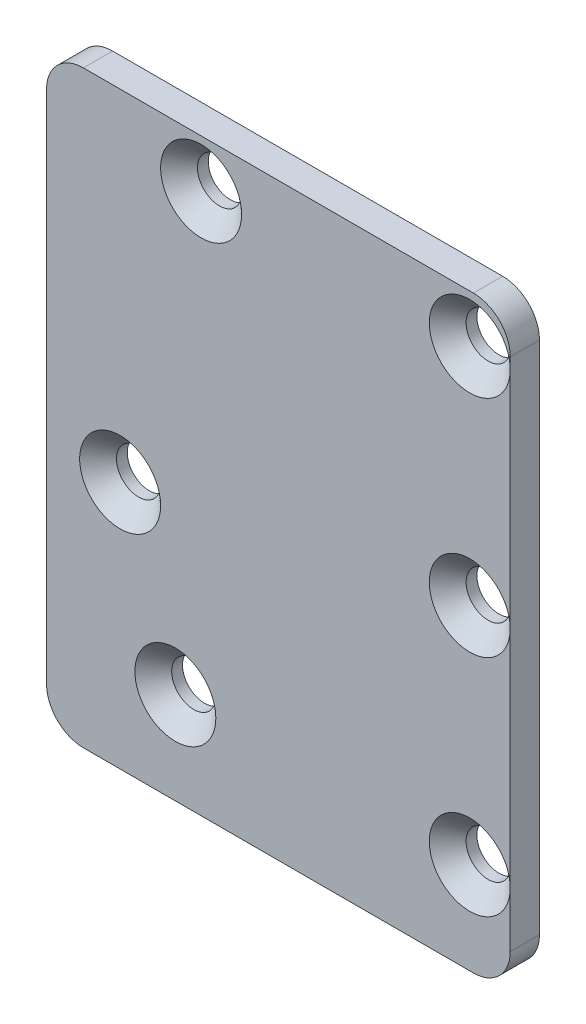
ISO-10303-21;
HEADER;
FILE_DESCRIPTION(('STEP AP214'),'2;1');
FILE_NAME('part.step','',(''),(''),'','','');
FILE_SCHEMA(('AUTOMOTIVE_DESIGN { 1 0 10303 214 1 1 1 1 }'));
ENDSEC;
DATA;
#1=APPLICATION_CONTEXT('core data for automotive mechanical design processes');
#2=APPLICATION_PROTOCOL_DEFINITION('international standard','automotive_design',2000,#1);
#3=PRODUCT_CONTEXT('',#1,'mechanical');
#4=PRODUCT('Part','Part','',(#3));
#5=PRODUCT_RELATED_PRODUCT_CATEGORY('part','',(#4));
#6=PRODUCT_DEFINITION_FORMATION('','',#4);
#7=PRODUCT_DEFINITION_CONTEXT('part definition',#1,'design');
#8=PRODUCT_DEFINITION('design','',#6,#7);
#9=PRODUCT_DEFINITION_SHAPE('','',#8);
#10=(LENGTH_UNIT() NAMED_UNIT(*) SI_UNIT(.MILLI.,.METRE.));
#11=(NAMED_UNIT(*) PLANE_ANGLE_UNIT() SI_UNIT($,.RADIAN.));
#12=(NAMED_UNIT(*) SI_UNIT($,.STERADIAN.) SOLID_ANGLE_UNIT());
#13=UNCERTAINTY_MEASURE_WITH_UNIT(LENGTH_MEASURE(1.E-05),#10,'distance_accuracy_value','');
#14=(GEOMETRIC_REPRESENTATION_CONTEXT(3) GLOBAL_UNCERTAINTY_ASSIGNED_CONTEXT((#13)) GLOBAL_UNIT_ASSIGNED_CONTEXT((#10,
#11,#12)) REPRESENTATION_CONTEXT('',''));
#15=CARTESIAN_POINT('',(0.,0.,0.));
#16=DIRECTION('',(0.,0.,1.));
#17=DIRECTION('',(1.,0.,0.));
#18=AXIS2_PLACEMENT_3D('',#15,#16,#17);
#19=CARTESIAN_POINT('',(0.,0.,1.5875));
#20=DIRECTION('',(1.,0.,0.));
#21=DIRECTION('',(0.,1.,0.));
#22=AXIS2_PLACEMENT_3D('',#19,#20,#21);
#23=PLANE('',#22);
#24=DIRECTION('',(0.,-1.,0.));
#25=VECTOR('',#24,1.);
#26=CARTESIAN_POINT('',(0.,0.,0.));
#27=LINE('',#26,#25);
#28=CARTESIAN_POINT('',(0.,30.,0.));
#29=VERTEX_POINT('',#28);
#30=CARTESIAN_POINT('',(0.,2.,0.));
#31=VERTEX_POINT('',#30);
#32=EDGE_CURVE('E511',#29,#31,#27,.T.);
#33=ORIENTED_EDGE('',*,*,#32,.T.);
#34=DIRECTION('',(0.,0.,-1.));
#35=VECTOR('',#34,1.);
#36=CARTESIAN_POINT('',(0.,2.,1.5875));
#37=LINE('',#36,#35);
#38=CARTESIAN_POINT('',(0.,2.,1.5875));
#39=VERTEX_POINT('',#38);
#40=EDGE_CURVE('E634',#31,#39,#37,.F.);
#41=ORIENTED_EDGE('',*,*,#40,.T.);
#42=DIRECTION('',(0.,-1.,0.));
#43=VECTOR('',#42,1.);
#44=CARTESIAN_POINT('',(0.,0.,1.5875));
#45=LINE('',#44,#43);
#46=CARTESIAN_POINT('',(0.,30.,1.5875));
#47=VERTEX_POINT('',#46);
#48=EDGE_CURVE('E513',#47,#39,#45,.T.);
#49=ORIENTED_EDGE('',*,*,#48,.F.);
#50=DIRECTION('',(0.,0.,-1.));
#51=VECTOR('',#50,1.);
#52=CARTESIAN_POINT('',(0.,30.,1.5875));
#53=LINE('',#52,#51);
#54=EDGE_CURVE('E625',#47,#29,#53,.T.);
#55=ORIENTED_EDGE('',*,*,#54,.T.);
#56=EDGE_LOOP('',(#33,#41,#49,#55));
#57=FACE_BOUND('',#56,.T.);
#58=ADVANCED_FACE('F67',(#57),#23,.F.);
#59=CARTESIAN_POINT('',(0.,0.,1.5875));
#60=DIRECTION('',(0.,1.,0.));
#61=DIRECTION('',(0.,0.,1.));
#62=AXIS2_PLACEMENT_3D('',#59,#60,#61);
#63=PLANE('',#62);
#64=DIRECTION('',(1.,0.,0.));
#65=VECTOR('',#64,1.);
#66=CARTESIAN_POINT('',(0.,0.,1.5875));
#67=LINE('',#66,#65);
#68=CARTESIAN_POINT('',(2.,0.,1.5875));
#69=VERTEX_POINT('',#68);
#70=CARTESIAN_POINT('',(23.2,0.,1.5875));
#71=VERTEX_POINT('',#70);
#72=EDGE_CURVE('E516',#69,#71,#67,.T.);
#73=ORIENTED_EDGE('',*,*,#72,.F.);
#74=DIRECTION('',(0.,0.,-1.));
#75=VECTOR('',#74,1.);
#76=CARTESIAN_POINT('',(2.,0.,1.5875));
#77=LINE('',#76,#75);
#78=CARTESIAN_POINT('',(2.,0.,0.));
#79=VERTEX_POINT('',#78);
#80=EDGE_CURVE('E704',#69,#79,#77,.T.);
#81=ORIENTED_EDGE('',*,*,#80,.T.);
#82=DIRECTION('',(1.,0.,0.));
#83=VECTOR('',#82,1.);
#84=CARTESIAN_POINT('',(0.,0.,0.));
#85=LINE('',#84,#83);
#86=CARTESIAN_POINT('',(23.2,0.,0.));
#87=VERTEX_POINT('',#86);
#88=EDGE_CURVE('E664',#79,#87,#85,.T.);
#89=ORIENTED_EDGE('',*,*,#88,.T.);
#90=DIRECTION('',(0.,0.,-1.));
#91=VECTOR('',#90,1.);
#92=CARTESIAN_POINT('',(23.2,0.,1.5875));
#93=LINE('',#92,#91);
#94=EDGE_CURVE('E670',#87,#71,#93,.F.);
#95=ORIENTED_EDGE('',*,*,#94,.T.);
#96=EDGE_LOOP('',(#73,#81,#89,#95));
#97=FACE_BOUND('',#96,.T.);
#98=ADVANCED_FACE('F594',(#97),#63,.F.);
#99=CARTESIAN_POINT('',(25.2,0.,1.5875));
#100=DIRECTION('',(-1.,0.,0.));
#101=DIRECTION('',(0.,-1.,0.));
#102=AXIS2_PLACEMENT_3D('',#99,#100,#101);
#103=PLANE('',#102);
#104=DIRECTION('',(0.,1.,0.));
#105=VECTOR('',#104,1.);
#106=CARTESIAN_POINT('',(25.2,0.,1.5875));
#107=LINE('',#106,#105);
#108=CARTESIAN_POINT('',(25.2,2.,1.5875));
#109=VERTEX_POINT('',#108);
#110=CARTESIAN_POINT('',(25.2,5.,1.5875));
#111=VERTEX_POINT('',#110);
#112=EDGE_CURVE('E523',#109,#111,#107,.T.);
#113=ORIENTED_EDGE('',*,*,#112,.F.);
#114=DIRECTION('',(0.,0.,-1.));
#115=VECTOR('',#114,1.);
#116=CARTESIAN_POINT('',(25.2,2.,1.5875));
#117=LINE('',#116,#115);
#118=CARTESIAN_POINT('',(25.2,2.,0.));
#119=VERTEX_POINT('',#118);
#120=EDGE_CURVE('E643',#109,#119,#117,.T.);
#121=ORIENTED_EDGE('',*,*,#120,.T.);
#122=DIRECTION('',(0.,1.,0.));
#123=VECTOR('',#122,1.);
#124=CARTESIAN_POINT('',(25.2,0.,0.));
#125=LINE('',#124,#123);
#126=CARTESIAN_POINT('',(25.2,30.,0.));
#127=VERTEX_POINT('',#126);
#128=EDGE_CURVE('E660',#119,#127,#125,.T.);
#129=ORIENTED_EDGE('',*,*,#128,.T.);
#130=DIRECTION('',(0.,0.,-1.));
#131=VECTOR('',#130,1.);
#132=CARTESIAN_POINT('',(25.2,30.,1.5875));
#133=LINE('',#132,#131);
#134=CARTESIAN_POINT('',(25.2,30.,1.5875));
#135=VERTEX_POINT('',#134);
#136=EDGE_CURVE('E640',#127,#135,#133,.F.);
#137=ORIENTED_EDGE('',*,*,#136,.T.);
#138=CARTESIAN_POINT('',(25.2,29.4,1.5875));
#139=VERTEX_POINT('',#138);
#140=EDGE_CURVE('E522',#139,#135,#107,.T.);
#141=ORIENTED_EDGE('',*,*,#140,.F.);
#142=CARTESIAN_POINT('',(25.2,17.2,1.5875));
#143=VERTEX_POINT('',#142);
#144=EDGE_CURVE('E707',#143,#139,#107,.T.);
#145=ORIENTED_EDGE('',*,*,#144,.F.);
#146=EDGE_CURVE('E528',#111,#143,#107,.T.);
#147=ORIENTED_EDGE('',*,*,#146,.F.);
#148=EDGE_LOOP('',(#113,#121,#129,#137,#141,#145,#147));
#149=FACE_BOUND('',#148,.T.);
#150=ADVANCED_FACE('F600',(#149),#103,.F.);
#151=CARTESIAN_POINT('',(0.,32.,1.5875));
#152=DIRECTION('',(0.,-1.,0.));
#153=DIRECTION('',(0.,0.,-1.));
#154=AXIS2_PLACEMENT_3D('',#151,#152,#153);
#155=PLANE('',#154);
#156=DIRECTION('',(-1.,0.,0.));
#157=VECTOR('',#156,1.);
#158=CARTESIAN_POINT('',(0.,32.,0.));
#159=LINE('',#158,#157);
#160=CARTESIAN_POINT('',(23.2,32.,0.));
#161=VERTEX_POINT('',#160);
#162=CARTESIAN_POINT('',(2.,32.,0.));
#163=VERTEX_POINT('',#162);
#164=EDGE_CURVE('E517',#161,#163,#159,.T.);
#165=ORIENTED_EDGE('',*,*,#164,.T.);
#166=DIRECTION('',(0.,0.,-1.));
#167=VECTOR('',#166,1.);
#168=CARTESIAN_POINT('',(2.,32.,1.5875));
#169=LINE('',#168,#167);
#170=CARTESIAN_POINT('',(2.,32.,1.5875));
#171=VERTEX_POINT('',#170);
#172=EDGE_CURVE('E13',#163,#171,#169,.F.);
#173=ORIENTED_EDGE('',*,*,#172,.T.);
#174=DIRECTION('',(-1.,0.,0.));
#175=VECTOR('',#174,1.);
#176=CARTESIAN_POINT('',(0.,32.,1.5875));
#177=LINE('',#176,#175);
#178=CARTESIAN_POINT('',(23.2,32.,1.5875));
#179=VERTEX_POINT('',#178);
#180=EDGE_CURVE('E527',#179,#171,#177,.T.);
#181=ORIENTED_EDGE('',*,*,#180,.F.);
#182=DIRECTION('',(0.,0.,-1.));
#183=VECTOR('',#182,1.);
#184=CARTESIAN_POINT('',(23.2,32.,1.5875));
#185=LINE('',#184,#183);
#186=EDGE_CURVE('E76',#179,#161,#185,.T.);
#187=ORIENTED_EDGE('',*,*,#186,.T.);
#188=EDGE_LOOP('',(#165,#173,#181,#187));
#189=FACE_BOUND('',#188,.T.);
#190=ADVANCED_FACE('F651',(#189),#155,.F.);
#191=CARTESIAN_POINT('',(0.,32.,1.5875));
#192=DIRECTION('',(0.,0.,-1.));
#193=DIRECTION('',(-1.,0.,0.));
#194=AXIS2_PLACEMENT_3D('',#191,#192,#193);
#195=PLANE('',#194);
#196=CARTESIAN_POINT('',(7.,5.,1.5875));
#197=DIRECTION('',(0.,0.,1.));
#198=DIRECTION('',(1.,0.,0.));
#199=AXIS2_PLACEMENT_3D('',#196,#197,#198);
#200=CIRCLE('',#199,2.2);
#201=CARTESIAN_POINT('',(9.2,5.,1.5875));
#202=VERTEX_POINT('',#201);
#203=EDGE_CURVE('E444',#202,#202,#200,.T.);
#204=ORIENTED_EDGE('',*,*,#203,.F.);
#205=EDGE_LOOP('',(#204));
#206=FACE_BOUND('',#205,.T.);
#207=CARTESIAN_POINT('',(4.,13.5,1.5875));
#208=DIRECTION('',(0.,0.,1.));
#209=DIRECTION('',(1.,0.,0.));
#210=AXIS2_PLACEMENT_3D('',#207,#208,#209);
#211=CIRCLE('',#210,2.2);
#212=CARTESIAN_POINT('',(6.2,13.5,1.5875));
#213=VERTEX_POINT('',#212);
#214=EDGE_CURVE('E482',#213,#213,#211,.T.);
#215=ORIENTED_EDGE('',*,*,#214,.F.);
#216=EDGE_LOOP('',(#215));
#217=FACE_BOUND('',#216,.T.);
#218=CARTESIAN_POINT('',(8.4,29.4,1.5875));
#219=DIRECTION('',(0.,0.,1.));
#220=DIRECTION('',(1.,0.,0.));
#221=AXIS2_PLACEMENT_3D('',#218,#219,#220);
#222=CIRCLE('',#221,2.2);
#223=CARTESIAN_POINT('',(10.6,29.4,1.5875));
#224=VERTEX_POINT('',#223);
#225=EDGE_CURVE('E499',#224,#224,#222,.T.);
#226=ORIENTED_EDGE('',*,*,#225,.F.);
#227=EDGE_LOOP('',(#226));
#228=FACE_BOUND('',#227,.T.);
#229=ORIENTED_EDGE('',*,*,#48,.T.);
#230=CARTESIAN_POINT('',(2.,2.,1.5875));
#231=DIRECTION('',(0.,0.,-1.));
#232=DIRECTION('',(-1.,0.,0.));
#233=AXIS2_PLACEMENT_3D('',#230,#231,#232);
#234=CIRCLE('',#233,2.);
#235=EDGE_CURVE('E632',#39,#69,#234,.F.);
#236=ORIENTED_EDGE('',*,*,#235,.T.);
#237=ORIENTED_EDGE('',*,*,#72,.T.);
#238=CARTESIAN_POINT('',(23.2,2.,1.5875));
#239=DIRECTION('',(0.,0.,-1.));
#240=DIRECTION('',(-1.,0.,0.));
#241=AXIS2_PLACEMENT_3D('',#238,#239,#240);
#242=CIRCLE('',#241,2.);
#243=EDGE_CURVE('E628',#71,#109,#242,.F.);
#244=ORIENTED_EDGE('',*,*,#243,.T.);
#245=ORIENTED_EDGE('',*,*,#112,.T.);
#246=CARTESIAN_POINT('',(23.,5.,1.5875));
#247=DIRECTION('',(0.,0.,1.));
#248=DIRECTION('',(1.,0.,0.));
#249=AXIS2_PLACEMENT_3D('',#246,#247,#248);
#250=CIRCLE('',#249,2.2);
#251=EDGE_CURVE('E534',#111,#111,#250,.T.);
#252=ORIENTED_EDGE('',*,*,#251,.F.);
#253=ORIENTED_EDGE('',*,*,#146,.T.);
#254=CARTESIAN_POINT('',(23.,17.2,1.5875));
#255=DIRECTION('',(0.,0.,1.));
#256=DIRECTION('',(1.,0.,0.));
#257=AXIS2_PLACEMENT_3D('',#254,#255,#256);
#258=CIRCLE('',#257,2.2);
#259=EDGE_CURVE('E549',#143,#143,#258,.T.);
#260=ORIENTED_EDGE('',*,*,#259,.F.);
#261=ORIENTED_EDGE('',*,*,#144,.T.);
#262=CARTESIAN_POINT('',(23.,29.4,1.5875));
#263=DIRECTION('',(0.,0.,1.));
#264=DIRECTION('',(1.,0.,0.));
#265=AXIS2_PLACEMENT_3D('',#262,#263,#264);
#266=CIRCLE('',#265,2.2);
#267=EDGE_CURVE('E560',#139,#139,#266,.T.);
#268=ORIENTED_EDGE('',*,*,#267,.F.);
#269=ORIENTED_EDGE('',*,*,#140,.T.);
#270=CARTESIAN_POINT('',(23.2,30.,1.5875));
#271=DIRECTION('',(0.,0.,-1.));
#272=DIRECTION('',(-1.,0.,0.));
#273=AXIS2_PLACEMENT_3D('',#270,#271,#272);
#274=CIRCLE('',#273,2.);
#275=EDGE_CURVE('E88',#135,#179,#274,.F.);
#276=ORIENTED_EDGE('',*,*,#275,.T.);
#277=ORIENTED_EDGE('',*,*,#180,.T.);
#278=CARTESIAN_POINT('',(2.,30.,1.5875));
#279=DIRECTION('',(0.,0.,-1.));
#280=DIRECTION('',(-1.,0.,0.));
#281=AXIS2_PLACEMENT_3D('',#278,#279,#280);
#282=CIRCLE('',#281,2.);
#283=EDGE_CURVE('E623',#171,#47,#282,.F.);
#284=ORIENTED_EDGE('',*,*,#283,.T.);
#285=EDGE_LOOP('',(#229,#236,#237,#244,#245,#252,#253,#260,#261,#268,#269,#276,#277,#284));
#286=FACE_BOUND('',#285,.T.);
#287=ADVANCED_FACE('F714',(#206,#217,#228,#286),#195,.F.);
#288=CARTESIAN_POINT('',(0.,32.,0.));
#289=DIRECTION('',(0.,0.,-1.));
#290=DIRECTION('',(-1.,0.,0.));
#291=AXIS2_PLACEMENT_3D('',#288,#289,#290);
#292=PLANE('',#291);
#293=DIRECTION('',(0.713851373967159,-0.700297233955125,0.));
#294=VECTOR('',#293,1.);
#295=CARTESIAN_POINT('',(13.1511251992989,13.4056631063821,0.));
#296=LINE('',#295,#294);
#297=CARTESIAN_POINT('',(3.75059446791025,22.6277027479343,0.));
#298=VERTEX_POINT('',#297);
#299=CARTESIAN_POINT('',(19.5505944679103,7.12770274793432,0.));
#300=VERTEX_POINT('',#299);
#301=EDGE_CURVE('E325',#298,#300,#296,.T.);
#302=ORIENTED_EDGE('',*,*,#301,.F.);
#303=CARTESIAN_POINT('',(2.35,21.2,0.));
#304=DIRECTION('',(0.,0.,-1.));
#305=DIRECTION('',(-1.,0.,0.));
#306=AXIS2_PLACEMENT_3D('',#303,#304,#305);
#307=CIRCLE('',#306,2.);
#308=CARTESIAN_POINT('',(0.949405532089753,19.7722972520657,0.));
#309=VERTEX_POINT('',#308);
#310=EDGE_CURVE('E267',#309,#298,#307,.T.);
#311=ORIENTED_EDGE('',*,*,#310,.F.);
#312=DIRECTION('',(0.713851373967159,-0.700297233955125,0.));
#313=VECTOR('',#312,1.);
#314=CARTESIAN_POINT('',(10.3499362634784,10.5502576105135,0.));
#315=LINE('',#314,#313);
#316=CARTESIAN_POINT('',(16.7494055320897,4.27229725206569,0.));
#317=VERTEX_POINT('',#316);
#318=EDGE_CURVE('E272',#309,#317,#315,.T.);
#319=ORIENTED_EDGE('',*,*,#318,.T.);
#320=CARTESIAN_POINT('',(18.15,5.7,0.));
#321=DIRECTION('',(0.,0.,-1.));
#322=DIRECTION('',(-1.,0.,0.));
#323=AXIS2_PLACEMENT_3D('',#320,#321,#322);
#324=CIRCLE('',#323,2.);
#325=EDGE_CURVE('E331',#300,#317,#324,.T.);
#326=ORIENTED_EDGE('',*,*,#325,.F.);
#327=EDGE_LOOP('',(#302,#311,#319,#326));
#328=FACE_BOUND('',#327,.T.);
#329=DIRECTION('',(0.78503973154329,-0.619445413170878,0.));
#330=VECTOR('',#329,1.);
#331=CARTESIAN_POINT('',(15.8380162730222,20.0719414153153,0.));
#332=LINE('',#331,#330);
#333=CARTESIAN_POINT('',(6.58889082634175,27.3700794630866,0.));
#334=VERTEX_POINT('',#333);
#335=CARTESIAN_POINT('',(19.3888908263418,17.2700794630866,0.));
#336=VERTEX_POINT('',#335);
#337=EDGE_CURVE('E421',#334,#336,#332,.T.);
#338=ORIENTED_EDGE('',*,*,#337,.F.);
#339=CARTESIAN_POINT('',(5.35,25.8,0.));
#340=DIRECTION('',(0.,0.,-1.));
#341=DIRECTION('',(-1.,0.,0.));
#342=AXIS2_PLACEMENT_3D('',#339,#340,#341);
#343=CIRCLE('',#342,2.);
#344=CARTESIAN_POINT('',(4.11110917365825,24.2299205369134,0.));
#345=VERTEX_POINT('',#344);
#346=EDGE_CURVE('E366',#345,#334,#343,.T.);
#347=ORIENTED_EDGE('',*,*,#346,.F.);
#348=DIRECTION('',(0.78503973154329,-0.619445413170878,0.));
#349=VECTOR('',#348,1.);
#350=CARTESIAN_POINT('',(13.3602346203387,16.9317824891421,0.));
#351=LINE('',#350,#349);
#352=CARTESIAN_POINT('',(16.9111091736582,14.1299205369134,0.));
#353=VERTEX_POINT('',#352);
#354=EDGE_CURVE('E439',#345,#353,#351,.T.);
#355=ORIENTED_EDGE('',*,*,#354,.T.);
#356=CARTESIAN_POINT('',(18.15,15.7,0.));
#357=DIRECTION('',(0.,0.,-1.));
#358=DIRECTION('',(-1.,0.,0.));
#359=AXIS2_PLACEMENT_3D('',#356,#357,#358);
#360=CIRCLE('',#359,2.);
#361=EDGE_CURVE('E427',#336,#353,#360,.T.);
#362=ORIENTED_EDGE('',*,*,#361,.F.);
#363=EDGE_LOOP('',(#338,#347,#355,#362));
#364=FACE_BOUND('',#363,.T.);
#365=CARTESIAN_POINT('',(7.,5.,0.));
#366=DIRECTION('',(0.,0.,1.));
#367=DIRECTION('',(1.,0.,0.));
#368=AXIS2_PLACEMENT_3D('',#365,#366,#367);
#369=CIRCLE('',#368,1.2);
#370=CARTESIAN_POINT('',(8.2,5.,0.));
#371=VERTEX_POINT('',#370);
#372=EDGE_CURVE('E540',#371,#371,#369,.T.);
#373=ORIENTED_EDGE('',*,*,#372,.T.);
#374=EDGE_LOOP('',(#373));
#375=FACE_BOUND('',#374,.T.);
#376=CARTESIAN_POINT('',(23.,5.,0.));
#377=DIRECTION('',(0.,0.,1.));
#378=DIRECTION('',(1.,0.,0.));
#379=AXIS2_PLACEMENT_3D('',#376,#377,#378);
#380=CIRCLE('',#379,1.2);
#381=CARTESIAN_POINT('',(24.2,5.,0.));
#382=VERTEX_POINT('',#381);
#383=EDGE_CURVE('E545',#382,#382,#380,.T.);
#384=ORIENTED_EDGE('',*,*,#383,.T.);
#385=EDGE_LOOP('',(#384));
#386=FACE_BOUND('',#385,.T.);
#387=CARTESIAN_POINT('',(23.,17.2,0.));
#388=DIRECTION('',(0.,0.,1.));
#389=DIRECTION('',(1.,0.,0.));
#390=AXIS2_PLACEMENT_3D('',#387,#388,#389);
#391=CIRCLE('',#390,1.2);
#392=CARTESIAN_POINT('',(24.2,17.2,0.));
#393=VERTEX_POINT('',#392);
#394=EDGE_CURVE('E555',#393,#393,#391,.T.);
#395=ORIENTED_EDGE('',*,*,#394,.T.);
#396=EDGE_LOOP('',(#395));
#397=FACE_BOUND('',#396,.T.);
#398=CARTESIAN_POINT('',(23.,29.4,0.));
#399=DIRECTION('',(0.,0.,1.));
#400=DIRECTION('',(1.,0.,0.));
#401=AXIS2_PLACEMENT_3D('',#398,#399,#400);
#402=CIRCLE('',#401,1.2);
#403=CARTESIAN_POINT('',(24.2,29.4,0.));
#404=VERTEX_POINT('',#403);
#405=EDGE_CURVE('E489',#404,#404,#402,.T.);
#406=ORIENTED_EDGE('',*,*,#405,.T.);
#407=EDGE_LOOP('',(#406));
#408=FACE_BOUND('',#407,.T.);
#409=CARTESIAN_POINT('',(4.,13.5,0.));
#410=DIRECTION('',(0.,0.,1.));
#411=DIRECTION('',(1.,0.,0.));
#412=AXIS2_PLACEMENT_3D('',#409,#410,#411);
#413=CIRCLE('',#412,1.2);
#414=CARTESIAN_POINT('',(5.2,13.5,0.));
#415=VERTEX_POINT('',#414);
#416=EDGE_CURVE('E495',#415,#415,#413,.T.);
#417=ORIENTED_EDGE('',*,*,#416,.T.);
#418=EDGE_LOOP('',(#417));
#419=FACE_BOUND('',#418,.T.);
#420=CARTESIAN_POINT('',(8.4,29.4,0.));
#421=DIRECTION('',(0.,0.,1.));
#422=DIRECTION('',(1.,0.,0.));
#423=AXIS2_PLACEMENT_3D('',#420,#421,#422);
#424=CIRCLE('',#423,1.2);
#425=CARTESIAN_POINT('',(9.6,29.4,0.));
#426=VERTEX_POINT('',#425);
#427=EDGE_CURVE('E506',#426,#426,#424,.T.);
#428=ORIENTED_EDGE('',*,*,#427,.T.);
#429=EDGE_LOOP('',(#428));
#430=FACE_BOUND('',#429,.T.);
#431=ORIENTED_EDGE('',*,*,#88,.F.);
#432=CARTESIAN_POINT('',(2.,2.,0.));
#433=DIRECTION('',(0.,0.,-1.));
#434=DIRECTION('',(-1.,0.,0.));
#435=AXIS2_PLACEMENT_3D('',#432,#433,#434);
#436=CIRCLE('',#435,2.);
#437=EDGE_CURVE('E687',#79,#31,#436,.T.);
#438=ORIENTED_EDGE('',*,*,#437,.T.);
#439=ORIENTED_EDGE('',*,*,#32,.F.);
#440=CARTESIAN_POINT('',(2.,30.,0.));
#441=DIRECTION('',(0.,0.,-1.));
#442=DIRECTION('',(-1.,0.,0.));
#443=AXIS2_PLACEMENT_3D('',#440,#441,#442);
#444=CIRCLE('',#443,2.);
#445=EDGE_CURVE('E658',#29,#163,#444,.T.);
#446=ORIENTED_EDGE('',*,*,#445,.T.);
#447=ORIENTED_EDGE('',*,*,#164,.F.);
#448=CARTESIAN_POINT('',(23.2,30.,0.));
#449=DIRECTION('',(0.,0.,-1.));
#450=DIRECTION('',(-1.,0.,0.));
#451=AXIS2_PLACEMENT_3D('',#448,#449,#450);
#452=CIRCLE('',#451,2.);
#453=EDGE_CURVE('E655',#161,#127,#452,.T.);
#454=ORIENTED_EDGE('',*,*,#453,.T.);
#455=ORIENTED_EDGE('',*,*,#128,.F.);
#456=CARTESIAN_POINT('',(23.2,2.,0.));
#457=DIRECTION('',(0.,0.,-1.));
#458=DIRECTION('',(-1.,0.,0.));
#459=AXIS2_PLACEMENT_3D('',#456,#457,#458);
#460=CIRCLE('',#459,2.);
#461=EDGE_CURVE('E682',#119,#87,#460,.T.);
#462=ORIENTED_EDGE('',*,*,#461,.T.);
#463=EDGE_LOOP('',(#431,#438,#439,#446,#447,#454,#455,#462));
#464=FACE_BOUND('',#463,.T.);
#465=ADVANCED_FACE('F575',(#328,#364,#375,#386,#397,#408,#419,#430,#464),#292,.T.);
#466=CARTESIAN_POINT('',(8.4,29.4,1.5875));
#467=DIRECTION('',(0.,0.,1.));
#468=DIRECTION('',(1.,0.,0.));
#469=AXIS2_PLACEMENT_3D('',#466,#467,#468);
#470=CYLINDRICAL_SURFACE('',#469,1.2);
#471=ORIENTED_EDGE('',*,*,#427,.F.);
#472=EDGE_LOOP('',(#471));
#473=FACE_BOUND('',#472,.T.);
#474=CARTESIAN_POINT('',(8.4,29.4,0.587499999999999));
#475=DIRECTION('',(0.,0.,1.));
#476=DIRECTION('',(1.,0.,0.));
#477=AXIS2_PLACEMENT_3D('',#474,#475,#476);
#478=CIRCLE('',#477,1.2);
#479=CARTESIAN_POINT('',(9.6,29.4,0.587499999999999));
#480=VERTEX_POINT('',#479);
#481=EDGE_CURVE('E512',#480,#480,#478,.T.);
#482=ORIENTED_EDGE('',*,*,#481,.T.);
#483=EDGE_LOOP('',(#482));
#484=FACE_BOUND('',#483,.T.);
#485=ADVANCED_FACE('F826',(#473,#484),#470,.F.);
#486=CARTESIAN_POINT('',(8.4,29.4,1.5875));
#487=DIRECTION('',(0.,0.,1.));
#488=DIRECTION('',(1.,0.,0.));
#489=AXIS2_PLACEMENT_3D('',#486,#487,#488);
#490=CONICAL_SURFACE('',#489,2.2,0.785398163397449);
#491=ORIENTED_EDGE('',*,*,#481,.F.);
#492=EDGE_LOOP('',(#491));
#493=FACE_BOUND('',#492,.T.);
#494=ORIENTED_EDGE('',*,*,#225,.T.);
#495=EDGE_LOOP('',(#494));
#496=FACE_BOUND('',#495,.T.);
#497=ADVANCED_FACE('F832',(#493,#496),#490,.F.);
#498=CARTESIAN_POINT('',(4.,13.5,1.5875));
#499=DIRECTION('',(0.,0.,1.));
#500=DIRECTION('',(1.,0.,0.));
#501=AXIS2_PLACEMENT_3D('',#498,#499,#500);
#502=CYLINDRICAL_SURFACE('',#501,1.2);
#503=ORIENTED_EDGE('',*,*,#416,.F.);
#504=EDGE_LOOP('',(#503));
#505=FACE_BOUND('',#504,.T.);
#506=CARTESIAN_POINT('',(4.,13.5,0.587499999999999));
#507=DIRECTION('',(0.,0.,1.));
#508=DIRECTION('',(1.,0.,0.));
#509=AXIS2_PLACEMENT_3D('',#506,#507,#508);
#510=CIRCLE('',#509,1.2);
#511=CARTESIAN_POINT('',(5.2,13.5,0.587499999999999));
#512=VERTEX_POINT('',#511);
#513=EDGE_CURVE('E488',#512,#512,#510,.T.);
#514=ORIENTED_EDGE('',*,*,#513,.T.);
#515=EDGE_LOOP('',(#514));
#516=FACE_BOUND('',#515,.T.);
#517=ADVANCED_FACE('F590',(#505,#516),#502,.F.);
#518=CARTESIAN_POINT('',(4.,13.5,1.5875));
#519=DIRECTION('',(0.,0.,1.));
#520=DIRECTION('',(1.,0.,0.));
#521=AXIS2_PLACEMENT_3D('',#518,#519,#520);
#522=CONICAL_SURFACE('',#521,2.2,0.785398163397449);
#523=ORIENTED_EDGE('',*,*,#513,.F.);
#524=EDGE_LOOP('',(#523));
#525=FACE_BOUND('',#524,.T.);
#526=ORIENTED_EDGE('',*,*,#214,.T.);
#527=EDGE_LOOP('',(#526));
#528=FACE_BOUND('',#527,.T.);
#529=ADVANCED_FACE('F581',(#525,#528),#522,.F.);
#530=CARTESIAN_POINT('',(23.,29.4,1.5875));
#531=DIRECTION('',(0.,0.,1.));
#532=DIRECTION('',(1.,0.,0.));
#533=AXIS2_PLACEMENT_3D('',#530,#531,#532);
#534=CYLINDRICAL_SURFACE('',#533,1.2);
#535=ORIENTED_EDGE('',*,*,#405,.F.);
#536=EDGE_LOOP('',(#535));
#537=FACE_BOUND('',#536,.T.);
#538=CARTESIAN_POINT('',(23.,29.4,0.587499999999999));
#539=DIRECTION('',(0.,0.,1.));
#540=DIRECTION('',(1.,0.,0.));
#541=AXIS2_PLACEMENT_3D('',#538,#539,#540);
#542=CIRCLE('',#541,1.2);
#543=CARTESIAN_POINT('',(24.2,29.4,0.587499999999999));
#544=VERTEX_POINT('',#543);
#545=EDGE_CURVE('E565',#544,#544,#542,.T.);
#546=ORIENTED_EDGE('',*,*,#545,.T.);
#547=EDGE_LOOP('',(#546));
#548=FACE_BOUND('',#547,.T.);
#549=ADVANCED_FACE('F578',(#537,#548),#534,.F.);
#550=CARTESIAN_POINT('',(23.,29.4,1.5875));
#551=DIRECTION('',(0.,0.,1.));
#552=DIRECTION('',(1.,0.,0.));
#553=AXIS2_PLACEMENT_3D('',#550,#551,#552);
#554=CONICAL_SURFACE('',#553,2.2,0.785398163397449);
#555=ORIENTED_EDGE('',*,*,#545,.F.);
#556=EDGE_LOOP('',(#555));
#557=FACE_BOUND('',#556,.T.);
#558=ORIENTED_EDGE('',*,*,#267,.T.);
#559=EDGE_LOOP('',(#558));
#560=FACE_BOUND('',#559,.T.);
#561=ADVANCED_FACE('F580',(#557,#560),#554,.F.);
#562=CARTESIAN_POINT('',(23.,17.2,1.5875));
#563=DIRECTION('',(0.,0.,1.));
#564=DIRECTION('',(1.,0.,0.));
#565=AXIS2_PLACEMENT_3D('',#562,#563,#564);
#566=CYLINDRICAL_SURFACE('',#565,1.2);
#567=ORIENTED_EDGE('',*,*,#394,.F.);
#568=EDGE_LOOP('',(#567));
#569=FACE_BOUND('',#568,.T.);
#570=CARTESIAN_POINT('',(23.,17.2,0.587499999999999));
#571=DIRECTION('',(0.,0.,1.));
#572=DIRECTION('',(1.,0.,0.));
#573=AXIS2_PLACEMENT_3D('',#570,#571,#572);
#574=CIRCLE('',#573,1.2);
#575=CARTESIAN_POINT('',(24.2,17.2,0.587499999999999));
#576=VERTEX_POINT('',#575);
#577=EDGE_CURVE('E561',#576,#576,#574,.T.);
#578=ORIENTED_EDGE('',*,*,#577,.T.);
#579=EDGE_LOOP('',(#578));
#580=FACE_BOUND('',#579,.T.);
#581=ADVANCED_FACE('F587',(#569,#580),#566,.F.);
#582=CARTESIAN_POINT('',(23.,17.2,1.5875));
#583=DIRECTION('',(0.,0.,1.));
#584=DIRECTION('',(1.,0.,0.));
#585=AXIS2_PLACEMENT_3D('',#582,#583,#584);
#586=CONICAL_SURFACE('',#585,2.2,0.785398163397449);
#587=ORIENTED_EDGE('',*,*,#577,.F.);
#588=EDGE_LOOP('',(#587));
#589=FACE_BOUND('',#588,.T.);
#590=ORIENTED_EDGE('',*,*,#259,.T.);
#591=EDGE_LOOP('',(#590));
#592=FACE_BOUND('',#591,.T.);
#593=ADVANCED_FACE('F718',(#589,#592),#586,.F.);
#594=CARTESIAN_POINT('',(23.,5.,1.5875));
#595=DIRECTION('',(0.,0.,1.));
#596=DIRECTION('',(1.,0.,0.));
#597=AXIS2_PLACEMENT_3D('',#594,#595,#596);
#598=CYLINDRICAL_SURFACE('',#597,1.2);
#599=ORIENTED_EDGE('',*,*,#383,.F.);
#600=EDGE_LOOP('',(#599));
#601=FACE_BOUND('',#600,.T.);
#602=CARTESIAN_POINT('',(23.,5.,0.587499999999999));
#603=DIRECTION('',(0.,0.,1.));
#604=DIRECTION('',(1.,0.,0.));
#605=AXIS2_PLACEMENT_3D('',#602,#603,#604);
#606=CIRCLE('',#605,1.2);
#607=CARTESIAN_POINT('',(24.2,5.,0.587499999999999));
#608=VERTEX_POINT('',#607);
#609=EDGE_CURVE('E539',#608,#608,#606,.T.);
#610=ORIENTED_EDGE('',*,*,#609,.T.);
#611=EDGE_LOOP('',(#610));
#612=FACE_BOUND('',#611,.T.);
#613=ADVANCED_FACE('F725',(#601,#612),#598,.F.);
#614=CARTESIAN_POINT('',(23.,5.,1.5875));
#615=DIRECTION('',(0.,0.,1.));
#616=DIRECTION('',(1.,0.,0.));
#617=AXIS2_PLACEMENT_3D('',#614,#615,#616);
#618=CONICAL_SURFACE('',#617,2.2,0.785398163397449);
#619=ORIENTED_EDGE('',*,*,#609,.F.);
#620=EDGE_LOOP('',(#619));
#621=FACE_BOUND('',#620,.T.);
#622=ORIENTED_EDGE('',*,*,#251,.T.);
#623=EDGE_LOOP('',(#622));
#624=FACE_BOUND('',#623,.T.);
#625=ADVANCED_FACE('F731',(#621,#624),#618,.F.);
#626=CARTESIAN_POINT('',(7.,5.,1.5875));
#627=DIRECTION('',(0.,0.,1.));
#628=DIRECTION('',(1.,0.,0.));
#629=AXIS2_PLACEMENT_3D('',#626,#627,#628);
#630=CYLINDRICAL_SURFACE('',#629,1.2);
#631=ORIENTED_EDGE('',*,*,#372,.F.);
#632=EDGE_LOOP('',(#631));
#633=FACE_BOUND('',#632,.T.);
#634=CARTESIAN_POINT('',(7.,5.,0.587499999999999));
#635=DIRECTION('',(0.,0.,1.));
#636=DIRECTION('',(1.,0.,0.));
#637=AXIS2_PLACEMENT_3D('',#634,#635,#636);
#638=CIRCLE('',#637,1.2);
#639=CARTESIAN_POINT('',(8.2,5.,0.587499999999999));
#640=VERTEX_POINT('',#639);
#641=EDGE_CURVE('E471',#640,#640,#638,.T.);
#642=ORIENTED_EDGE('',*,*,#641,.T.);
#643=EDGE_LOOP('',(#642));
#644=FACE_BOUND('',#643,.T.);
#645=ADVANCED_FACE('F739',(#633,#644),#630,.F.);
#646=CARTESIAN_POINT('',(7.,5.,1.5875));
#647=DIRECTION('',(0.,0.,1.));
#648=DIRECTION('',(1.,0.,0.));
#649=AXIS2_PLACEMENT_3D('',#646,#647,#648);
#650=CONICAL_SURFACE('',#649,2.2,0.785398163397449);
#651=ORIENTED_EDGE('',*,*,#641,.F.);
#652=EDGE_LOOP('',(#651));
#653=FACE_BOUND('',#652,.T.);
#654=ORIENTED_EDGE('',*,*,#203,.T.);
#655=EDGE_LOOP('',(#654));
#656=FACE_BOUND('',#655,.T.);
#657=ADVANCED_FACE('F743',(#653,#656),#650,.F.);
#658=CARTESIAN_POINT('',(15.8380162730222,20.0719414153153,0.75));
#659=DIRECTION('',(0.619445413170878,0.78503973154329,0.));
#660=DIRECTION('',(-0.78503973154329,0.619445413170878,0.));
#661=AXIS2_PLACEMENT_3D('',#658,#659,#660);
#662=PLANE('',#661);
#663=ORIENTED_EDGE('',*,*,#337,.T.);
#664=DIRECTION('',(0.,0.,-1.));
#665=VECTOR('',#664,1.);
#666=CARTESIAN_POINT('',(19.3888908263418,17.2700794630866,0.75));
#667=LINE('',#666,#665);
#668=CARTESIAN_POINT('',(19.3888908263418,17.2700794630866,0.75));
#669=VERTEX_POINT('',#668);
#670=EDGE_CURVE('E451',#669,#336,#667,.T.);
#671=ORIENTED_EDGE('',*,*,#670,.F.);
#672=DIRECTION('',(0.78503973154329,-0.619445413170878,0.));
#673=VECTOR('',#672,1.);
#674=CARTESIAN_POINT('',(15.8380162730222,20.0719414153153,0.75));
#675=LINE('',#674,#673);
#676=CARTESIAN_POINT('',(6.58889082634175,27.3700794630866,0.75));
#677=VERTEX_POINT('',#676);
#678=EDGE_CURVE('E382',#677,#669,#675,.T.);
#679=ORIENTED_EDGE('',*,*,#678,.F.);
#680=DIRECTION('',(0.,0.,-1.));
#681=VECTOR('',#680,1.);
#682=CARTESIAN_POINT('',(6.58889082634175,27.3700794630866,0.75));
#683=LINE('',#682,#681);
#684=EDGE_CURVE('E441',#677,#334,#683,.T.);
#685=ORIENTED_EDGE('',*,*,#684,.T.);
#686=EDGE_LOOP('',(#663,#671,#679,#685));
#687=FACE_BOUND('',#686,.T.);
#688=ADVANCED_FACE('F747',(#687),#662,.F.);
#689=CARTESIAN_POINT('',(5.35,25.8,0.75));
#690=DIRECTION('',(0.,0.,-1.));
#691=DIRECTION('',(-1.,0.,0.));
#692=AXIS2_PLACEMENT_3D('',#689,#690,#691);
#693=CYLINDRICAL_SURFACE('',#692,2.);
#694=ORIENTED_EDGE('',*,*,#346,.T.);
#695=ORIENTED_EDGE('',*,*,#684,.F.);
#696=CARTESIAN_POINT('',(5.35,25.8,0.75));
#697=DIRECTION('',(0.,0.,-1.));
#698=DIRECTION('',(-1.,0.,0.));
#699=AXIS2_PLACEMENT_3D('',#696,#697,#698);
#700=CIRCLE('',#699,2.);
#701=CARTESIAN_POINT('',(4.11110917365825,24.2299205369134,0.75));
#702=VERTEX_POINT('',#701);
#703=EDGE_CURVE('E398',#702,#677,#700,.T.);
#704=ORIENTED_EDGE('',*,*,#703,.F.);
#705=DIRECTION('',(0.,0.,-1.));
#706=VECTOR('',#705,1.);
#707=CARTESIAN_POINT('',(4.11110917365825,24.2299205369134,0.75));
#708=LINE('',#707,#706);
#709=EDGE_CURVE('E445',#702,#345,#708,.T.);
#710=ORIENTED_EDGE('',*,*,#709,.T.);
#711=EDGE_LOOP('',(#694,#695,#704,#710));
#712=FACE_BOUND('',#711,.T.);
#713=ADVANCED_FACE('F769',(#712),#693,.F.);
#714=CARTESIAN_POINT('',(13.3602346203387,16.9317824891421,0.75));
#715=DIRECTION('',(0.619445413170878,0.78503973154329,0.));
#716=DIRECTION('',(-0.78503973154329,0.619445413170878,0.));
#717=AXIS2_PLACEMENT_3D('',#714,#715,#716);
#718=PLANE('',#717);
#719=ORIENTED_EDGE('',*,*,#354,.F.);
#720=ORIENTED_EDGE('',*,*,#709,.F.);
#721=DIRECTION('',(0.78503973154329,-0.619445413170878,0.));
#722=VECTOR('',#721,1.);
#723=CARTESIAN_POINT('',(13.3602346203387,16.9317824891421,0.75));
#724=LINE('',#723,#722);
#725=CARTESIAN_POINT('',(16.9111091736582,14.1299205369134,0.75));
#726=VERTEX_POINT('',#725);
#727=EDGE_CURVE('E395',#702,#726,#724,.T.);
#728=ORIENTED_EDGE('',*,*,#727,.T.);
#729=DIRECTION('',(0.,0.,-1.));
#730=VECTOR('',#729,1.);
#731=CARTESIAN_POINT('',(16.9111091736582,14.1299205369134,0.75));
#732=LINE('',#731,#730);
#733=EDGE_CURVE('E448',#726,#353,#732,.T.);
#734=ORIENTED_EDGE('',*,*,#733,.T.);
#735=EDGE_LOOP('',(#719,#720,#728,#734));
#736=FACE_BOUND('',#735,.T.);
#737=ADVANCED_FACE('F753',(#736),#718,.T.);
#738=CARTESIAN_POINT('',(5.35,25.8,0.75));
#739=DIRECTION('',(0.,0.,-1.));
#740=DIRECTION('',(-1.,0.,0.));
#741=AXIS2_PLACEMENT_3D('',#738,#739,#740);
#742=CYLINDRICAL_SURFACE('',#741,0.800000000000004);
#743=CARTESIAN_POINT('',(5.35,25.8,0.));
#744=DIRECTION('',(0.,0.,-1.));
#745=DIRECTION('',(-1.,0.,0.));
#746=AXIS2_PLACEMENT_3D('',#743,#744,#745);
#747=CIRCLE('',#746,0.800000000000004);
#748=CARTESIAN_POINT('',(4.85444366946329,25.1719682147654,0.));
#749=VERTEX_POINT('',#748);
#750=CARTESIAN_POINT('',(5.8455563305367,26.4280317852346,0.));
#751=VERTEX_POINT('',#750);
#752=EDGE_CURVE('E343',#749,#751,#747,.T.);
#753=ORIENTED_EDGE('',*,*,#752,.F.);
#754=DIRECTION('',(0.,0.,-1.));
#755=VECTOR('',#754,1.);
#756=CARTESIAN_POINT('',(4.85444366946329,25.1719682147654,0.75));
#757=LINE('',#756,#755);
#758=CARTESIAN_POINT('',(4.85444366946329,25.1719682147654,0.75));
#759=VERTEX_POINT('',#758);
#760=EDGE_CURVE('E403',#759,#749,#757,.T.);
#761=ORIENTED_EDGE('',*,*,#760,.F.);
#762=CARTESIAN_POINT('',(5.35,25.8,0.75));
#763=DIRECTION('',(0.,0.,-1.));
#764=DIRECTION('',(-1.,0.,0.));
#765=AXIS2_PLACEMENT_3D('',#762,#763,#764);
#766=CIRCLE('',#765,0.800000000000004);
#767=CARTESIAN_POINT('',(5.8455563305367,26.4280317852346,0.75));
#768=VERTEX_POINT('',#767);
#769=EDGE_CURVE('E361',#759,#768,#766,.T.);
#770=ORIENTED_EDGE('',*,*,#769,.T.);
#771=DIRECTION('',(0.,0.,-1.));
#772=VECTOR('',#771,1.);
#773=CARTESIAN_POINT('',(5.8455563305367,26.4280317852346,0.75));
#774=LINE('',#773,#772);
#775=EDGE_CURVE('E455',#768,#751,#774,.T.);
#776=ORIENTED_EDGE('',*,*,#775,.T.);
#777=EDGE_LOOP('',(#753,#761,#770,#776));
#778=FACE_BOUND('',#777,.T.);
#779=ADVANCED_FACE('F749',(#778),#742,.T.);
#780=CARTESIAN_POINT('',(15.0946817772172,19.1298937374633,0.75));
#781=DIRECTION('',(-0.619445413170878,-0.78503973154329,0.));
#782=DIRECTION('',(0.78503973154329,-0.619445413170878,0.));
#783=AXIS2_PLACEMENT_3D('',#780,#781,#782);
#784=PLANE('',#783);
#785=DIRECTION('',(-0.78503973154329,0.619445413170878,0.));
#786=VECTOR('',#785,1.);
#787=CARTESIAN_POINT('',(15.0946817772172,19.1298937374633,0.));
#788=LINE('',#787,#786);
#789=CARTESIAN_POINT('',(18.6455563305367,16.3280317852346,0.));
#790=VERTEX_POINT('',#789);
#791=EDGE_CURVE('E416',#790,#751,#788,.T.);
#792=ORIENTED_EDGE('',*,*,#791,.T.);
#793=ORIENTED_EDGE('',*,*,#775,.F.);
#794=DIRECTION('',(-0.78503973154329,0.619445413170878,0.));
#795=VECTOR('',#794,1.);
#796=CARTESIAN_POINT('',(15.0946817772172,19.1298937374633,0.75));
#797=LINE('',#796,#795);
#798=CARTESIAN_POINT('',(18.6455563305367,16.3280317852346,0.75));
#799=VERTEX_POINT('',#798);
#800=EDGE_CURVE('E377',#799,#768,#797,.T.);
#801=ORIENTED_EDGE('',*,*,#800,.F.);
#802=DIRECTION('',(0.,0.,-1.));
#803=VECTOR('',#802,1.);
#804=CARTESIAN_POINT('',(18.6455563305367,16.3280317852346,0.75));
#805=LINE('',#804,#803);
#806=EDGE_CURVE('E458',#799,#790,#805,.T.);
#807=ORIENTED_EDGE('',*,*,#806,.T.);
#808=EDGE_LOOP('',(#792,#793,#801,#807));
#809=FACE_BOUND('',#808,.T.);
#810=ADVANCED_FACE('F752',(#809),#784,.F.);
#811=CARTESIAN_POINT('',(18.15,15.7,0.75));
#812=DIRECTION('',(0.,0.,-1.));
#813=DIRECTION('',(-1.,0.,0.));
#814=AXIS2_PLACEMENT_3D('',#811,#812,#813);
#815=CYLINDRICAL_SURFACE('',#814,0.800000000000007);
#816=CARTESIAN_POINT('',(18.15,15.7,0.));
#817=DIRECTION('',(0.,0.,-1.));
#818=DIRECTION('',(-1.,0.,0.));
#819=AXIS2_PLACEMENT_3D('',#816,#817,#818);
#820=CIRCLE('',#819,0.800000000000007);
#821=CARTESIAN_POINT('',(17.6544436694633,15.0719682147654,0.));
#822=VERTEX_POINT('',#821);
#823=EDGE_CURVE('E422',#790,#822,#820,.T.);
#824=ORIENTED_EDGE('',*,*,#823,.F.);
#825=ORIENTED_EDGE('',*,*,#806,.F.);
#826=CARTESIAN_POINT('',(18.15,15.7,0.75));
#827=DIRECTION('',(0.,0.,-1.));
#828=DIRECTION('',(-1.,0.,0.));
#829=AXIS2_PLACEMENT_3D('',#826,#827,#828);
#830=CIRCLE('',#829,0.800000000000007);
#831=CARTESIAN_POINT('',(17.6544436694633,15.0719682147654,0.75));
#832=VERTEX_POINT('',#831);
#833=EDGE_CURVE('E374',#799,#832,#830,.T.);
#834=ORIENTED_EDGE('',*,*,#833,.T.);
#835=DIRECTION('',(0.,0.,-1.));
#836=VECTOR('',#835,1.);
#837=CARTESIAN_POINT('',(17.6544436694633,15.0719682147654,0.75));
#838=LINE('',#837,#836);
#839=EDGE_CURVE('E461',#832,#822,#838,.T.);
#840=ORIENTED_EDGE('',*,*,#839,.T.);
#841=EDGE_LOOP('',(#824,#825,#834,#840));
#842=FACE_BOUND('',#841,.T.);
#843=ADVANCED_FACE('F759',(#842),#815,.T.);
#844=CARTESIAN_POINT('',(14.1035691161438,17.8738301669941,0.75));
#845=DIRECTION('',(-0.619445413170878,-0.78503973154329,0.));
#846=DIRECTION('',(0.78503973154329,-0.619445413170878,0.));
#847=AXIS2_PLACEMENT_3D('',#844,#845,#846);
#848=PLANE('',#847);
#849=DIRECTION('',(-0.78503973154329,0.619445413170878,0.));
#850=VECTOR('',#849,1.);
#851=CARTESIAN_POINT('',(14.1035691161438,17.8738301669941,0.));
#852=LINE('',#851,#850);
#853=EDGE_CURVE('E408',#822,#749,#852,.T.);
#854=ORIENTED_EDGE('',*,*,#853,.F.);
#855=ORIENTED_EDGE('',*,*,#839,.F.);
#856=DIRECTION('',(-0.78503973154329,0.619445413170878,0.));
#857=VECTOR('',#856,1.);
#858=CARTESIAN_POINT('',(14.1035691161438,17.8738301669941,0.75));
#859=LINE('',#858,#857);
#860=EDGE_CURVE('E365',#832,#759,#859,.T.);
#861=ORIENTED_EDGE('',*,*,#860,.T.);
#862=ORIENTED_EDGE('',*,*,#760,.T.);
#863=EDGE_LOOP('',(#854,#855,#861,#862));
#864=FACE_BOUND('',#863,.T.);
#865=ADVANCED_FACE('F755',(#864),#848,.T.);
#866=CARTESIAN_POINT('',(18.15,15.7,0.75));
#867=DIRECTION('',(0.,0.,-1.));
#868=DIRECTION('',(-1.,0.,0.));
#869=AXIS2_PLACEMENT_3D('',#866,#867,#868);
#870=CYLINDRICAL_SURFACE('',#869,2.);
#871=ORIENTED_EDGE('',*,*,#361,.T.);
#872=ORIENTED_EDGE('',*,*,#733,.F.);
#873=CARTESIAN_POINT('',(18.15,15.7,0.75));
#874=DIRECTION('',(0.,0.,-1.));
#875=DIRECTION('',(-1.,0.,0.));
#876=AXIS2_PLACEMENT_3D('',#873,#874,#875);
#877=CIRCLE('',#876,2.);
#878=EDGE_CURVE('E387',#669,#726,#877,.T.);
#879=ORIENTED_EDGE('',*,*,#878,.F.);
#880=ORIENTED_EDGE('',*,*,#670,.T.);
#881=EDGE_LOOP('',(#871,#872,#879,#880));
#882=FACE_BOUND('',#881,.T.);
#883=ADVANCED_FACE('F758',(#882),#870,.F.);
#884=CARTESIAN_POINT('',(0.,0.,0.75));
#885=DIRECTION('',(0.,0.,-1.));
#886=DIRECTION('',(-1.,0.,0.));
#887=AXIS2_PLACEMENT_3D('',#884,#885,#886);
#888=PLANE('',#887);
#889=ORIENTED_EDGE('',*,*,#769,.F.);
#890=ORIENTED_EDGE('',*,*,#860,.F.);
#891=ORIENTED_EDGE('',*,*,#833,.F.);
#892=ORIENTED_EDGE('',*,*,#800,.T.);
#893=EDGE_LOOP('',(#889,#890,#891,#892));
#894=FACE_BOUND('',#893,.T.);
#895=ORIENTED_EDGE('',*,*,#678,.T.);
#896=ORIENTED_EDGE('',*,*,#878,.T.);
#897=ORIENTED_EDGE('',*,*,#727,.F.);
#898=ORIENTED_EDGE('',*,*,#703,.T.);
#899=EDGE_LOOP('',(#895,#896,#897,#898));
#900=FACE_BOUND('',#899,.T.);
#901=ADVANCED_FACE('F773',(#894,#900),#888,.T.);
#902=ORIENTED_EDGE('',*,*,#853,.T.);
#903=ORIENTED_EDGE('',*,*,#752,.T.);
#904=ORIENTED_EDGE('',*,*,#791,.F.);
#905=ORIENTED_EDGE('',*,*,#823,.T.);
#906=EDGE_LOOP('',(#902,#903,#904,#905));
#907=FACE_BOUND('',#906,.T.);
#908=ADVANCED_FACE('F783',(#907),#292,.T.);
#909=CARTESIAN_POINT('',(13.1511251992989,13.4056631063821,0.75));
#910=DIRECTION('',(0.700297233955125,0.713851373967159,0.));
#911=DIRECTION('',(-0.713851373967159,0.700297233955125,0.));
#912=AXIS2_PLACEMENT_3D('',#909,#910,#911);
#913=PLANE('',#912);
#914=ORIENTED_EDGE('',*,*,#301,.T.);
#915=DIRECTION('',(0.,0.,-1.));
#916=VECTOR('',#915,1.);
#917=CARTESIAN_POINT('',(19.5505944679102,7.12770274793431,0.75));
#918=LINE('',#917,#916);
#919=CARTESIAN_POINT('',(19.5505944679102,7.12770274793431,0.75));
#920=VERTEX_POINT('',#919);
#921=EDGE_CURVE('E350',#920,#300,#918,.T.);
#922=ORIENTED_EDGE('',*,*,#921,.F.);
#923=DIRECTION('',(0.713851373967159,-0.700297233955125,0.));
#924=VECTOR('',#923,1.);
#925=CARTESIAN_POINT('',(13.1511251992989,13.4056631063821,0.75));
#926=LINE('',#925,#924);
#927=CARTESIAN_POINT('',(3.75059446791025,22.6277027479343,0.75));
#928=VERTEX_POINT('',#927);
#929=EDGE_CURVE('E291',#928,#920,#926,.T.);
#930=ORIENTED_EDGE('',*,*,#929,.F.);
#931=DIRECTION('',(0.,0.,-1.));
#932=VECTOR('',#931,1.);
#933=CARTESIAN_POINT('',(3.75059446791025,22.6277027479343,0.75));
#934=LINE('',#933,#932);
#935=EDGE_CURVE('E340',#928,#298,#934,.T.);
#936=ORIENTED_EDGE('',*,*,#935,.T.);
#937=EDGE_LOOP('',(#914,#922,#930,#936));
#938=FACE_BOUND('',#937,.T.);
#939=ADVANCED_FACE('F799',(#938),#913,.F.);
#940=CARTESIAN_POINT('',(2.35,21.2,0.75));
#941=DIRECTION('',(0.,0.,-1.));
#942=DIRECTION('',(-1.,0.,0.));
#943=AXIS2_PLACEMENT_3D('',#940,#941,#942);
#944=CYLINDRICAL_SURFACE('',#943,2.);
#945=ORIENTED_EDGE('',*,*,#310,.T.);
#946=ORIENTED_EDGE('',*,*,#935,.F.);
#947=CARTESIAN_POINT('',(2.35,21.2,0.75));
#948=DIRECTION('',(0.,0.,-1.));
#949=DIRECTION('',(-1.,0.,0.));
#950=AXIS2_PLACEMENT_3D('',#947,#948,#949);
#951=CIRCLE('',#950,2.);
#952=CARTESIAN_POINT('',(0.949405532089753,19.7722972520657,0.75));
#953=VERTEX_POINT('',#952);
#954=EDGE_CURVE('E259',#953,#928,#951,.T.);
#955=ORIENTED_EDGE('',*,*,#954,.F.);
#956=DIRECTION('',(0.,0.,-1.));
#957=VECTOR('',#956,1.);
#958=CARTESIAN_POINT('',(0.949405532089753,19.7722972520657,0.75));
#959=LINE('',#958,#957);
#960=EDGE_CURVE('E344',#953,#309,#959,.T.);
#961=ORIENTED_EDGE('',*,*,#960,.T.);
#962=EDGE_LOOP('',(#945,#946,#955,#961));
#963=FACE_BOUND('',#962,.T.);
#964=ADVANCED_FACE('F802',(#963),#944,.F.);
#965=CARTESIAN_POINT('',(10.3499362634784,10.5502576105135,0.75));
#966=DIRECTION('',(0.700297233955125,0.713851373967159,0.));
#967=DIRECTION('',(-0.713851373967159,0.700297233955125,0.));
#968=AXIS2_PLACEMENT_3D('',#965,#966,#967);
#969=PLANE('',#968);
#970=ORIENTED_EDGE('',*,*,#318,.F.);
#971=ORIENTED_EDGE('',*,*,#960,.F.);
#972=DIRECTION('',(0.713851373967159,-0.700297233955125,0.));
#973=VECTOR('',#972,1.);
#974=CARTESIAN_POINT('',(10.3499362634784,10.5502576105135,0.75));
#975=LINE('',#974,#973);
#976=CARTESIAN_POINT('',(16.7494055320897,4.27229725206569,0.75));
#977=VERTEX_POINT('',#976);
#978=EDGE_CURVE('E304',#953,#977,#975,.T.);
#979=ORIENTED_EDGE('',*,*,#978,.T.);
#980=DIRECTION('',(0.,0.,-1.));
#981=VECTOR('',#980,1.);
#982=CARTESIAN_POINT('',(16.7494055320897,4.27229725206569,0.75));
#983=LINE('',#982,#981);
#984=EDGE_CURVE('E347',#977,#317,#983,.T.);
#985=ORIENTED_EDGE('',*,*,#984,.T.);
#986=EDGE_LOOP('',(#970,#971,#979,#985));
#987=FACE_BOUND('',#986,.T.);
#988=ADVANCED_FACE('F788',(#987),#969,.T.);
#989=CARTESIAN_POINT('',(2.35,21.2,0.75));
#990=DIRECTION('',(0.,0.,-1.));
#991=DIRECTION('',(-1.,0.,0.));
#992=AXIS2_PLACEMENT_3D('',#989,#990,#991);
#993=CYLINDRICAL_SURFACE('',#992,0.800000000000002);
#994=CARTESIAN_POINT('',(2.35,21.2,0.));
#995=DIRECTION('',(0.,0.,-1.));
#996=DIRECTION('',(-1.,0.,0.));
#997=AXIS2_PLACEMENT_3D('',#994,#995,#996);
#998=CIRCLE('',#997,0.800000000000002);
#999=CARTESIAN_POINT('',(1.7897622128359,20.6289189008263,0.));
#1000=VERTEX_POINT('',#999);
#1001=CARTESIAN_POINT('',(2.9102377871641,21.7710810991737,0.));
#1002=VERTEX_POINT('',#1001);
#1003=EDGE_CURVE('E257',#1000,#1002,#998,.T.);
#1004=ORIENTED_EDGE('',*,*,#1003,.F.);
#1005=DIRECTION('',(0.,0.,-1.));
#1006=VECTOR('',#1005,1.);
#1007=CARTESIAN_POINT('',(1.7897622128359,20.6289189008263,0.75));
#1008=LINE('',#1007,#1006);
#1009=CARTESIAN_POINT('',(1.7897622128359,20.6289189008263,0.75));
#1010=VERTEX_POINT('',#1009);
#1011=EDGE_CURVE('E243',#1010,#1000,#1008,.T.);
#1012=ORIENTED_EDGE('',*,*,#1011,.F.);
#1013=CARTESIAN_POINT('',(2.35,21.2,0.75));
#1014=DIRECTION('',(0.,0.,-1.));
#1015=DIRECTION('',(-1.,0.,0.));
#1016=AXIS2_PLACEMENT_3D('',#1013,#1014,#1015);
#1017=CIRCLE('',#1016,0.800000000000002);
#1018=CARTESIAN_POINT('',(2.9102377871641,21.7710810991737,0.75));
#1019=VERTEX_POINT('',#1018);
#1020=EDGE_CURVE('E251',#1010,#1019,#1017,.T.);
#1021=ORIENTED_EDGE('',*,*,#1020,.T.);
#1022=DIRECTION('',(0.,0.,-1.));
#1023=VECTOR('',#1022,1.);
#1024=CARTESIAN_POINT('',(2.9102377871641,21.7710810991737,0.75));
#1025=LINE('',#1024,#1023);
#1026=EDGE_CURVE('E354',#1019,#1002,#1025,.T.);
#1027=ORIENTED_EDGE('',*,*,#1026,.T.);
#1028=EDGE_LOOP('',(#1004,#1012,#1021,#1027));
#1029=FACE_BOUND('',#1028,.T.);
#1030=ADVANCED_FACE('F254',(#1029),#993,.T.);
#1031=CARTESIAN_POINT('',(12.3107685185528,12.5490414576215,0.75));
#1032=DIRECTION('',(-0.700297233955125,-0.713851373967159,0.));
#1033=DIRECTION('',(0.713851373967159,-0.700297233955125,0.));
#1034=AXIS2_PLACEMENT_3D('',#1031,#1032,#1033);
#1035=PLANE('',#1034);
#1036=DIRECTION('',(-0.713851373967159,0.700297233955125,0.));
#1037=VECTOR('',#1036,1.);
#1038=CARTESIAN_POINT('',(12.3107685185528,12.5490414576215,0.));
#1039=LINE('',#1038,#1037);
#1040=CARTESIAN_POINT('',(18.7102377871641,6.27108109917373,0.));
#1041=VERTEX_POINT('',#1040);
#1042=EDGE_CURVE('E320',#1041,#1002,#1039,.T.);
#1043=ORIENTED_EDGE('',*,*,#1042,.T.);
#1044=ORIENTED_EDGE('',*,*,#1026,.F.);
#1045=DIRECTION('',(-0.713851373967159,0.700297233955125,0.));
#1046=VECTOR('',#1045,1.);
#1047=CARTESIAN_POINT('',(12.3107685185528,12.5490414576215,0.75));
#1048=LINE('',#1047,#1046);
#1049=CARTESIAN_POINT('',(18.7102377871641,6.27108109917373,0.75));
#1050=VERTEX_POINT('',#1049);
#1051=EDGE_CURVE('E265',#1050,#1019,#1048,.T.);
#1052=ORIENTED_EDGE('',*,*,#1051,.F.);
#1053=DIRECTION('',(0.,0.,-1.));
#1054=VECTOR('',#1053,1.);
#1055=CARTESIAN_POINT('',(18.7102377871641,6.27108109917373,0.75));
#1056=LINE('',#1055,#1054);
#1057=EDGE_CURVE('E356',#1050,#1041,#1056,.T.);
#1058=ORIENTED_EDGE('',*,*,#1057,.T.);
#1059=EDGE_LOOP('',(#1043,#1044,#1052,#1058));
#1060=FACE_BOUND('',#1059,.T.);
#1061=ADVANCED_FACE('F787',(#1060),#1035,.F.);
#1062=CARTESIAN_POINT('',(18.15,5.7,0.75));
#1063=DIRECTION('',(0.,0.,-1.));
#1064=DIRECTION('',(-1.,0.,0.));
#1065=AXIS2_PLACEMENT_3D('',#1062,#1063,#1064);
#1066=CYLINDRICAL_SURFACE('',#1065,0.800000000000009);
#1067=CARTESIAN_POINT('',(18.15,5.7,0.));
#1068=DIRECTION('',(0.,0.,-1.));
#1069=DIRECTION('',(-1.,0.,0.));
#1070=AXIS2_PLACEMENT_3D('',#1067,#1068,#1069);
#1071=CIRCLE('',#1070,0.800000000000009);
#1072=CARTESIAN_POINT('',(17.5897622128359,5.12891890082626,0.));
#1073=VERTEX_POINT('',#1072);
#1074=EDGE_CURVE('E326',#1041,#1073,#1071,.T.);
#1075=ORIENTED_EDGE('',*,*,#1074,.F.);
#1076=ORIENTED_EDGE('',*,*,#1057,.F.);
#1077=CARTESIAN_POINT('',(18.15,5.7,0.75));
#1078=DIRECTION('',(0.,0.,-1.));
#1079=DIRECTION('',(-1.,0.,0.));
#1080=AXIS2_PLACEMENT_3D('',#1077,#1078,#1079);
#1081=CIRCLE('',#1080,0.800000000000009);
#1082=CARTESIAN_POINT('',(17.5897622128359,5.12891890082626,0.75));
#1083=VERTEX_POINT('',#1082);
#1084=EDGE_CURVE('E250',#1050,#1083,#1081,.T.);
#1085=ORIENTED_EDGE('',*,*,#1084,.T.);
#1086=DIRECTION('',(0.,0.,-1.));
#1087=VECTOR('',#1086,1.);
#1088=CARTESIAN_POINT('',(17.5897622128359,5.12891890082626,0.75));
#1089=LINE('',#1088,#1087);
#1090=EDGE_CURVE('E245',#1083,#1073,#1089,.T.);
#1091=ORIENTED_EDGE('',*,*,#1090,.T.);
#1092=EDGE_LOOP('',(#1075,#1076,#1085,#1091));
#1093=FACE_BOUND('',#1092,.T.);
#1094=ADVANCED_FACE('F792',(#1093),#1066,.T.);
#1095=CARTESIAN_POINT('',(11.1902929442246,11.4068792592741,0.75));
#1096=DIRECTION('',(-0.700297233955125,-0.713851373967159,0.));
#1097=DIRECTION('',(0.713851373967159,-0.700297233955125,0.));
#1098=AXIS2_PLACEMENT_3D('',#1095,#1096,#1097);
#1099=PLANE('',#1098);
#1100=DIRECTION('',(-0.713851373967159,0.700297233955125,0.));
#1101=VECTOR('',#1100,1.);
#1102=CARTESIAN_POINT('',(11.1902929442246,11.4068792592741,0.));
#1103=LINE('',#1102,#1101);
#1104=EDGE_CURVE('E314',#1073,#1000,#1103,.T.);
#1105=ORIENTED_EDGE('',*,*,#1104,.F.);
#1106=ORIENTED_EDGE('',*,*,#1090,.F.);
#1107=DIRECTION('',(-0.713851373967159,0.700297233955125,0.));
#1108=VECTOR('',#1107,1.);
#1109=CARTESIAN_POINT('',(11.1902929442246,11.4068792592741,0.75));
#1110=LINE('',#1109,#1108);
#1111=EDGE_CURVE('E239',#1083,#1010,#1110,.T.);
#1112=ORIENTED_EDGE('',*,*,#1111,.T.);
#1113=ORIENTED_EDGE('',*,*,#1011,.T.);
#1114=EDGE_LOOP('',(#1105,#1106,#1112,#1113));
#1115=FACE_BOUND('',#1114,.T.);
#1116=ADVANCED_FACE('F242',(#1115),#1099,.T.);
#1117=CARTESIAN_POINT('',(18.15,5.7,0.75));
#1118=DIRECTION('',(0.,0.,-1.));
#1119=DIRECTION('',(-1.,0.,0.));
#1120=AXIS2_PLACEMENT_3D('',#1117,#1118,#1119);
#1121=CYLINDRICAL_SURFACE('',#1120,2.);
#1122=ORIENTED_EDGE('',*,*,#325,.T.);
#1123=ORIENTED_EDGE('',*,*,#984,.F.);
#1124=CARTESIAN_POINT('',(18.15,5.7,0.75));
#1125=DIRECTION('',(0.,0.,-1.));
#1126=DIRECTION('',(-1.,0.,0.));
#1127=AXIS2_PLACEMENT_3D('',#1124,#1125,#1126);
#1128=CIRCLE('',#1127,2.);
#1129=EDGE_CURVE('E296',#920,#977,#1128,.T.);
#1130=ORIENTED_EDGE('',*,*,#1129,.F.);
#1131=ORIENTED_EDGE('',*,*,#921,.T.);
#1132=EDGE_LOOP('',(#1122,#1123,#1130,#1131));
#1133=FACE_BOUND('',#1132,.T.);
#1134=ADVANCED_FACE('F791',(#1133),#1121,.F.);
#1135=CARTESIAN_POINT('',(0.,0.,0.75));
#1136=DIRECTION('',(0.,0.,-1.));
#1137=DIRECTION('',(-1.,0.,0.));
#1138=AXIS2_PLACEMENT_3D('',#1135,#1136,#1137);
#1139=PLANE('',#1138);
#1140=ORIENTED_EDGE('',*,*,#1020,.F.);
#1141=ORIENTED_EDGE('',*,*,#1111,.F.);
#1142=ORIENTED_EDGE('',*,*,#1084,.F.);
#1143=ORIENTED_EDGE('',*,*,#1051,.T.);
#1144=EDGE_LOOP('',(#1140,#1141,#1142,#1143));
#1145=FACE_BOUND('',#1144,.T.);
#1146=ORIENTED_EDGE('',*,*,#929,.T.);
#1147=ORIENTED_EDGE('',*,*,#1129,.T.);
#1148=ORIENTED_EDGE('',*,*,#978,.F.);
#1149=ORIENTED_EDGE('',*,*,#954,.T.);
#1150=EDGE_LOOP('',(#1146,#1147,#1148,#1149));
#1151=FACE_BOUND('',#1150,.T.);
#1152=ADVANCED_FACE('F262',(#1145,#1151),#1139,.T.);
#1153=ORIENTED_EDGE('',*,*,#1104,.T.);
#1154=ORIENTED_EDGE('',*,*,#1003,.T.);
#1155=ORIENTED_EDGE('',*,*,#1042,.F.);
#1156=ORIENTED_EDGE('',*,*,#1074,.T.);
#1157=EDGE_LOOP('',(#1153,#1154,#1155,#1156));
#1158=FACE_BOUND('',#1157,.T.);
#1159=ADVANCED_FACE('F610',(#1158),#292,.T.);
#1160=CARTESIAN_POINT('',(2.,2.,1.5875));
#1161=DIRECTION('',(0.,0.,-1.));
#1162=DIRECTION('',(-1.,0.,0.));
#1163=AXIS2_PLACEMENT_3D('',#1160,#1161,#1162);
#1164=CYLINDRICAL_SURFACE('',#1163,2.);
#1165=ORIENTED_EDGE('',*,*,#235,.F.);
#1166=ORIENTED_EDGE('',*,*,#40,.F.);
#1167=ORIENTED_EDGE('',*,*,#437,.F.);
#1168=ORIENTED_EDGE('',*,*,#80,.F.);
#1169=EDGE_LOOP('',(#1165,#1166,#1167,#1168));
#1170=FACE_BOUND('',#1169,.T.);
#1171=ADVANCED_FACE('F606',(#1170),#1164,.T.);
#1172=CARTESIAN_POINT('',(23.2,2.,1.5875));
#1173=DIRECTION('',(0.,0.,-1.));
#1174=DIRECTION('',(-1.,0.,0.));
#1175=AXIS2_PLACEMENT_3D('',#1172,#1173,#1174);
#1176=CYLINDRICAL_SURFACE('',#1175,2.);
#1177=ORIENTED_EDGE('',*,*,#243,.F.);
#1178=ORIENTED_EDGE('',*,*,#94,.F.);
#1179=ORIENTED_EDGE('',*,*,#461,.F.);
#1180=ORIENTED_EDGE('',*,*,#120,.F.);
#1181=EDGE_LOOP('',(#1177,#1178,#1179,#1180));
#1182=FACE_BOUND('',#1181,.T.);
#1183=ADVANCED_FACE('F609',(#1182),#1176,.T.);
#1184=CARTESIAN_POINT('',(2.,30.,1.5875));
#1185=DIRECTION('',(0.,0.,-1.));
#1186=DIRECTION('',(-1.,0.,0.));
#1187=AXIS2_PLACEMENT_3D('',#1184,#1185,#1186);
#1188=CYLINDRICAL_SURFACE('',#1187,2.);
#1189=ORIENTED_EDGE('',*,*,#283,.F.);
#1190=ORIENTED_EDGE('',*,*,#172,.F.);
#1191=ORIENTED_EDGE('',*,*,#445,.F.);
#1192=ORIENTED_EDGE('',*,*,#54,.F.);
#1193=EDGE_LOOP('',(#1189,#1190,#1191,#1192));
#1194=FACE_BOUND('',#1193,.T.);
#1195=ADVANCED_FACE('F613',(#1194),#1188,.T.);
#1196=CARTESIAN_POINT('',(23.2,30.,1.5875));
#1197=DIRECTION('',(0.,0.,-1.));
#1198=DIRECTION('',(-1.,0.,0.));
#1199=AXIS2_PLACEMENT_3D('',#1196,#1197,#1198);
#1200=CYLINDRICAL_SURFACE('',#1199,2.);
#1201=ORIENTED_EDGE('',*,*,#275,.F.);
#1202=ORIENTED_EDGE('',*,*,#136,.F.);
#1203=ORIENTED_EDGE('',*,*,#453,.F.);
#1204=ORIENTED_EDGE('',*,*,#186,.F.);
#1205=EDGE_LOOP('',(#1201,#1202,#1203,#1204));
#1206=FACE_BOUND('',#1205,.T.);
#1207=ADVANCED_FACE('F69',(#1206),#1200,.T.);
#1208=CLOSED_SHELL('',(#58,#98,#150,#190,#287,#465,#485,#497,#517,#529,#549,#561,#581,#593,#613,
#625,#645,#657,#688,#713,#737,#779,#810,#843,#865,#883,#901,#908,#939,#964,#988,#1030,#1061,
#1094,#1116,#1134,#1152,#1159,#1171,#1183,#1195,#1207));
#1209=MANIFOLD_SOLID_BREP('B2',#1208);
#1210=ADVANCED_BREP_SHAPE_REPRESENTATION('',(#18,#1209),#14);
#1211=SHAPE_DEFINITION_REPRESENTATION(#9,#1210);
ENDSEC;
END-ISO-10303-21;
